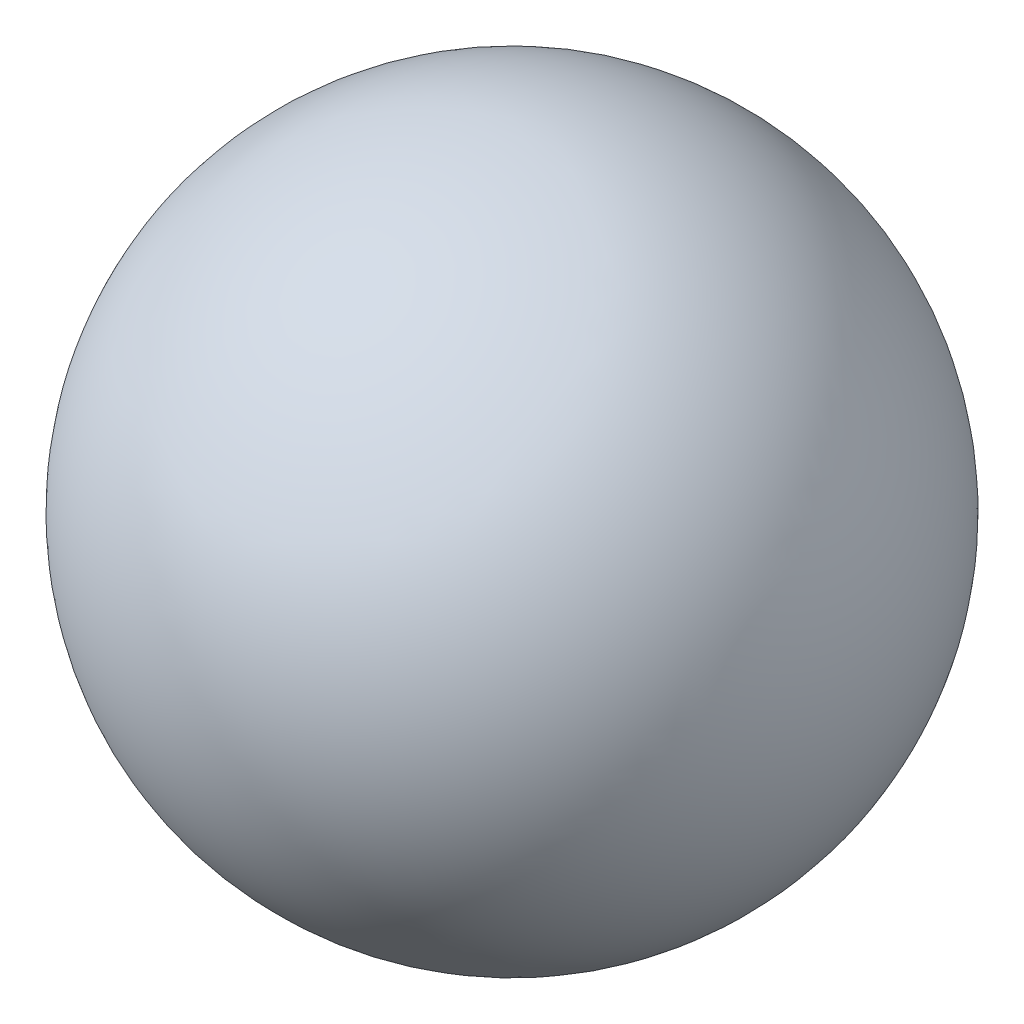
from build123d import *


with BuildPart() as part:
    # Sketch1 → Revolve1 (revolve)
    with BuildSketch(Plane(origin=(0, 0, 0), x_dir=(1, 0, 0), z_dir=(0, 1, 0))):
        with BuildLine():
            Line((-4.76, 0), (4.76, 0))
            ThreePointArc((4.76, 0), (0, 4.76), (-4.76, 0))
        make_face()
    revolve(axis=Axis((-4.76, 0, 0), (1, 0, 0)))


solid = part.part
